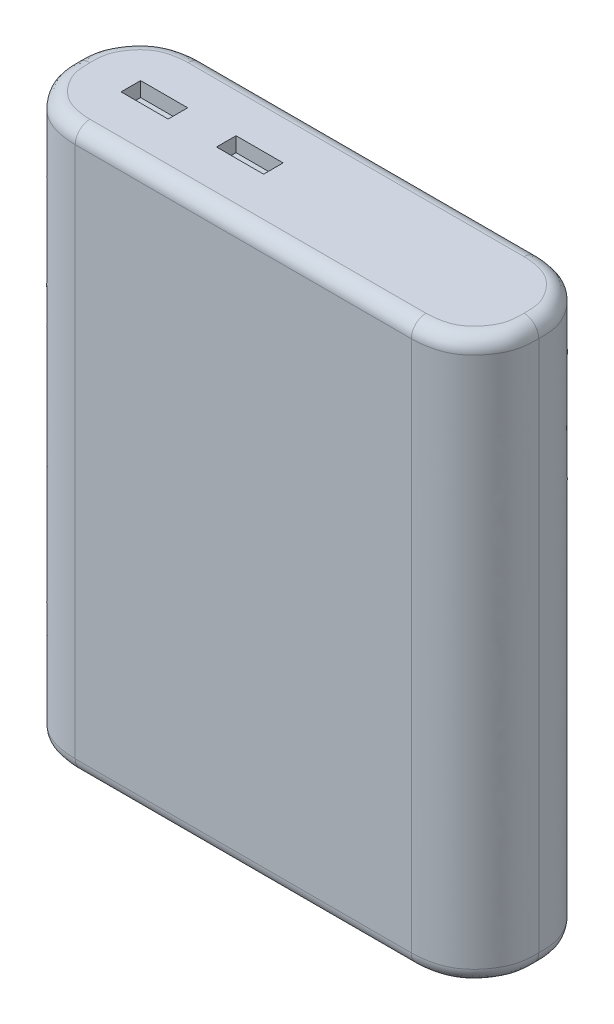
from build123d import *

# Parameters (mm, degrees)
BOSS_EXTRUDE1_DEPTH = 96.9772
FILLET1_R           = 2.54
SKETCH2_W           = 8.135390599
SKETCH2_H           = 3.375910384
CUT_EXTRUDE1_DEPTH  = 2.54
SKETCH3_R           = 0.4191
CUT_EXTRUDE2_DEPTH  = 2.54


with BuildPart() as part:
    # Sketch1 → Boss-Extrude1 (new body)
    with BuildSketch(Plane(origin=(0, 0, 0), x_dir=(1, 0, 0), z_dir=(0, 1, 0))):
        with BuildLine():
            Line((-29.0322, 0), (29.0322, 0))
            add(Edge.make_bspline(
                [(29.0322, 0), (30.333964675, 0), (35.196931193, -0.529582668), (39.334024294, -5.586470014), (40.0431, -8.492247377), (40.0431, -11.0109)],
                knots=[0, 0, 0, 0, 0.304751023, 0.695248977, 1, 1, 1, 1], degree=3))
            add(Edge.make_bspline(
                [(29.0322, -22.0218), (30.333964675, -22.0218), (35.196931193, -21.492217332), (39.334024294, -16.435329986), (40.0431, -13.529552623), (40.0431, -11.0109)],
                knots=[0, 0, 0, 0, 0.304751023, 0.695248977, 1, 1, 1, 1], degree=3))
            Line((29.0322, -22.0218), (-29.0322, -22.0218))
            add(Edge.make_bspline(
                [(-29.0322, -22.0218), (-30.333964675, -22.0218), (-35.196931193, -21.492217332), (-39.334024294, -16.435329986), (-40.0431, -13.529552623), (-40.0431, -11.0109)],
                knots=[0, 0, 0, 0, 0.304751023, 0.695248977, 1, 1, 1, 1], degree=3))
            add(Edge.make_bspline(
                [(-29.0322, 0), (-30.333964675, 0), (-35.196931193, -0.529582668), (-39.334024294, -5.586470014), (-40.0431, -8.492247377), (-40.0431, -11.0109)],
                knots=[0, 0, 0, 0, 0.304751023, 0.695248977, 1, 1, 1, 1], degree=3))
        make_face()
    extrude(amount=BOSS_EXTRUDE1_DEPTH)

    # Fillet1
    fillet1_edges = [part.edges().sort_by_distance(p)[0] for p in [
        (-37.004090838, 96.9772, 3.049980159),
        (-37.004090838, 96.9772, 18.971819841),
        (0, 96.9772, 22.0218),
        (37.004090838, 96.9772, 18.971819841),
        (37.004090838, 96.9772, 3.049980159),
        (37.004090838, 0, 18.971819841),
        (0, 0, 22.0218),
        (-37.004090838, 0, 18.971819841),
        (0, 96.9772, 0),
        (-37.004090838, 0, 3.049980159),
        (0, 0, 0),
        (37.004090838, 0, 3.049980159),
    ]]
    fillet(fillet1_edges, radius=FILLET1_R)

    # Sketch2 → Cut-Extrude1 (cut)
    with BuildSketch(Plane(origin=(0, 96.9772, 0), x_dir=(1, 0, 0), z_dir=(0, 1, 0))):
        with Locations((-26.370840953, -11.0109)):
            Rectangle(SKETCH2_W, SKETCH2_H)
        with Locations((-9.878688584, -11.0109)):
            Rectangle(SKETCH2_W, SKETCH2_H)
    extrude(amount=-CUT_EXTRUDE1_DEPTH, mode=Mode.SUBTRACT)

    # Sketch3 → Cut-Extrude2 (cut)
    with BuildSketch(Plane(origin=(0, 0, 0), x_dir=(-1, 0, 0), z_dir=(0, 0, -1))):
        with Locations((-22.3012, 82.2579)):
            Circle(SKETCH3_R)
        with Locations((-22.3012, 78.913566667)):
            Circle(SKETCH3_R)
        with Locations((-22.3012, 75.569233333)):
            Circle(SKETCH3_R)
        with Locations((-22.3012, 72.2249)):
            Circle(SKETCH3_R)
    extrude(amount=-CUT_EXTRUDE2_DEPTH, mode=Mode.SUBTRACT)


solid = part.part
